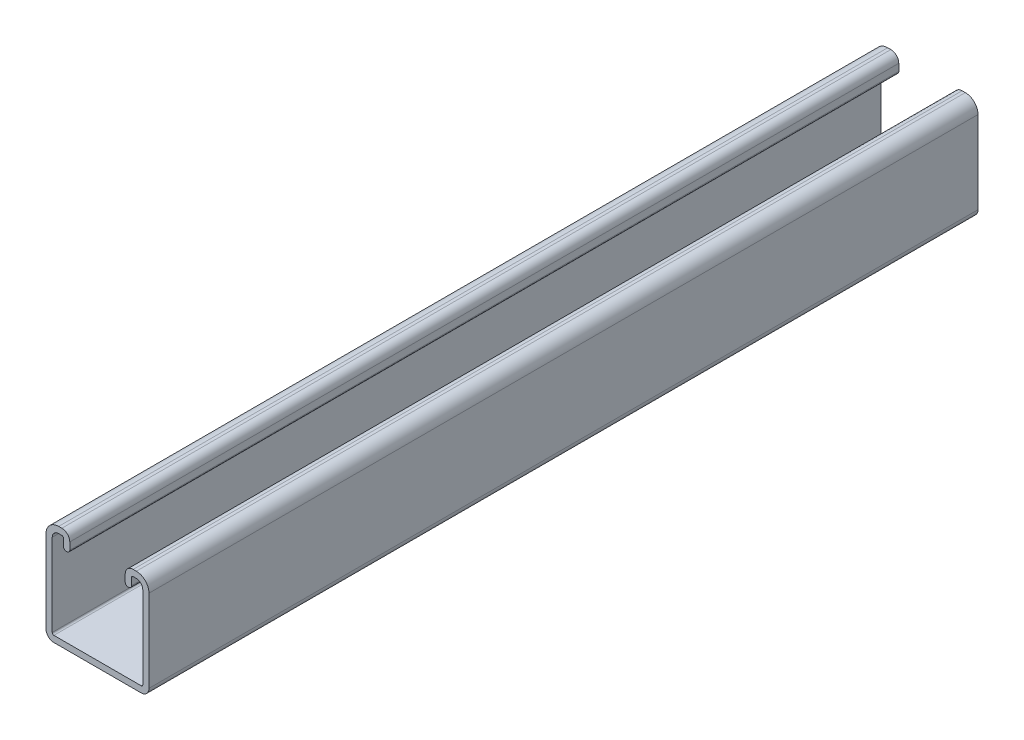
ISO-10303-21;
HEADER;
FILE_DESCRIPTION(('STEP AP214'),'2;1');
FILE_NAME('part.step','',(''),(''),'','','');
FILE_SCHEMA(('AUTOMOTIVE_DESIGN { 1 0 10303 214 1 1 1 1 }'));
ENDSEC;
DATA;
#1=APPLICATION_CONTEXT('core data for automotive mechanical design processes');
#2=APPLICATION_PROTOCOL_DEFINITION('international standard','automotive_design',2000,#1);
#3=PRODUCT_CONTEXT('',#1,'mechanical');
#4=PRODUCT('Part','Part','',(#3));
#5=PRODUCT_RELATED_PRODUCT_CATEGORY('part','',(#4));
#6=PRODUCT_DEFINITION_FORMATION('','',#4);
#7=PRODUCT_DEFINITION_CONTEXT('part definition',#1,'design');
#8=PRODUCT_DEFINITION('design','',#6,#7);
#9=PRODUCT_DEFINITION_SHAPE('','',#8);
#10=(LENGTH_UNIT() NAMED_UNIT(*) SI_UNIT(.MILLI.,.METRE.));
#11=(NAMED_UNIT(*) PLANE_ANGLE_UNIT() SI_UNIT($,.RADIAN.));
#12=(NAMED_UNIT(*) SI_UNIT($,.STERADIAN.) SOLID_ANGLE_UNIT());
#13=UNCERTAINTY_MEASURE_WITH_UNIT(LENGTH_MEASURE(1.E-05),#10,'distance_accuracy_value','');
#14=(GEOMETRIC_REPRESENTATION_CONTEXT(3) GLOBAL_UNCERTAINTY_ASSIGNED_CONTEXT((#13)) GLOBAL_UNIT_ASSIGNED_CONTEXT((#10,
#11,#12)) REPRESENTATION_CONTEXT('',''));
#15=CARTESIAN_POINT('',(0.,0.,0.));
#16=DIRECTION('',(0.,0.,1.));
#17=DIRECTION('',(1.,0.,0.));
#18=AXIS2_PLACEMENT_3D('',#15,#16,#17);
#19=CARTESIAN_POINT('',(0.,36.195,332.232));
#20=DIRECTION('',(1.,0.,0.));
#21=DIRECTION('',(0.,1.,0.));
#22=AXIS2_PLACEMENT_3D('',#19,#20,#21);
#23=PLANE('',#22);
#24=DIRECTION('',(0.,-1.,0.));
#25=VECTOR('',#24,1.);
#26=CARTESIAN_POINT('',(0.,36.195,0.));
#27=LINE('',#26,#25);
#28=CARTESIAN_POINT('',(0.,36.195,0.));
#29=VERTEX_POINT('',#28);
#30=CARTESIAN_POINT('',(0.,3.17500000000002,0.));
#31=VERTEX_POINT('',#30);
#32=EDGE_CURVE('E275',#29,#31,#27,.T.);
#33=ORIENTED_EDGE('',*,*,#32,.T.);
#34=DIRECTION('',(0.,0.,-1.));
#35=VECTOR('',#34,1.);
#36=CARTESIAN_POINT('',(0.,3.17500000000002,332.232));
#37=LINE('',#36,#35);
#38=CARTESIAN_POINT('',(0.,3.17500000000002,332.232));
#39=VERTEX_POINT('',#38);
#40=EDGE_CURVE('E11',#39,#31,#37,.T.);
#41=ORIENTED_EDGE('',*,*,#40,.F.);
#42=DIRECTION('',(0.,-1.,0.));
#43=VECTOR('',#42,1.);
#44=CARTESIAN_POINT('',(0.,36.195,332.232));
#45=LINE('',#44,#43);
#46=CARTESIAN_POINT('',(0.,36.195,332.232));
#47=VERTEX_POINT('',#46);
#48=EDGE_CURVE('E358',#47,#39,#45,.T.);
#49=ORIENTED_EDGE('',*,*,#48,.F.);
#50=DIRECTION('',(0.,0.,-1.));
#51=VECTOR('',#50,1.);
#52=CARTESIAN_POINT('',(0.,36.195,332.232));
#53=LINE('',#52,#51);
#54=EDGE_CURVE('E51',#47,#29,#53,.T.);
#55=ORIENTED_EDGE('',*,*,#54,.T.);
#56=EDGE_LOOP('',(#33,#41,#49,#55));
#57=FACE_BOUND('',#56,.T.);
#58=ADVANCED_FACE('F35',(#57),#23,.F.);
#59=CARTESIAN_POINT('',(3.17499999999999,3.175,332.232));
#60=DIRECTION('',(0.,0.,-1.));
#61=DIRECTION('',(-1.,0.,0.));
#62=AXIS2_PLACEMENT_3D('',#59,#60,#61);
#63=CYLINDRICAL_SURFACE('',#62,3.175);
#64=CARTESIAN_POINT('',(3.17499999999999,3.175,0.));
#65=DIRECTION('',(0.,0.,1.));
#66=DIRECTION('',(1.,0.,0.));
#67=AXIS2_PLACEMENT_3D('',#64,#65,#66);
#68=CIRCLE('',#67,3.175);
#69=CARTESIAN_POINT('',(3.17500000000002,0.,0.));
#70=VERTEX_POINT('',#69);
#71=EDGE_CURVE('E277',#31,#70,#68,.T.);
#72=ORIENTED_EDGE('',*,*,#71,.T.);
#73=DIRECTION('',(0.,0.,-1.));
#74=VECTOR('',#73,1.);
#75=CARTESIAN_POINT('',(3.17500000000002,0.,332.232));
#76=LINE('',#75,#74);
#77=CARTESIAN_POINT('',(3.17500000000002,0.,332.232));
#78=VERTEX_POINT('',#77);
#79=EDGE_CURVE('E43',#78,#70,#76,.T.);
#80=ORIENTED_EDGE('',*,*,#79,.F.);
#81=CARTESIAN_POINT('',(3.17499999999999,3.175,332.232));
#82=DIRECTION('',(0.,0.,1.));
#83=DIRECTION('',(1.,0.,0.));
#84=AXIS2_PLACEMENT_3D('',#81,#82,#83);
#85=CIRCLE('',#84,3.175);
#86=EDGE_CURVE('E161',#39,#78,#85,.T.);
#87=ORIENTED_EDGE('',*,*,#86,.F.);
#88=ORIENTED_EDGE('',*,*,#40,.T.);
#89=EDGE_LOOP('',(#72,#80,#87,#88));
#90=FACE_BOUND('',#89,.T.);
#91=ADVANCED_FACE('F516',(#90),#63,.T.);
#92=CARTESIAN_POINT('',(3.17500000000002,0.,332.232));
#93=DIRECTION('',(0.,1.,0.));
#94=DIRECTION('',(0.,0.,1.));
#95=AXIS2_PLACEMENT_3D('',#92,#93,#94);
#96=PLANE('',#95);
#97=CARTESIAN_POINT('',(20.6375,0.,272.693321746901));
#98=DIRECTION('',(0.,1.,0.));
#99=DIRECTION('',(0.,0.,1.));
#100=AXIS2_PLACEMENT_3D('',#97,#98,#99);
#101=CIRCLE('',#100,2.54);
#102=CARTESIAN_POINT('',(20.6375,0.,275.233321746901));
#103=VERTEX_POINT('',#102);
#104=EDGE_CURVE('E527',#103,#103,#101,.T.);
#105=ORIENTED_EDGE('',*,*,#104,.T.);
#106=EDGE_LOOP('',(#105));
#107=FACE_BOUND('',#106,.T.);
#108=CARTESIAN_POINT('',(20.6375,0.,50.8));
#109=DIRECTION('',(0.,1.,0.));
#110=DIRECTION('',(0.,0.,1.));
#111=AXIS2_PLACEMENT_3D('',#108,#109,#110);
#112=CIRCLE('',#111,2.54);
#113=CARTESIAN_POINT('',(20.6375,0.,53.34));
#114=VERTEX_POINT('',#113);
#115=EDGE_CURVE('E278',#114,#114,#112,.T.);
#116=ORIENTED_EDGE('',*,*,#115,.T.);
#117=EDGE_LOOP('',(#116));
#118=FACE_BOUND('',#117,.T.);
#119=CARTESIAN_POINT('',(20.6375,0.,127.));
#120=DIRECTION('',(0.,1.,0.));
#121=DIRECTION('',(0.,0.,1.));
#122=AXIS2_PLACEMENT_3D('',#119,#120,#121);
#123=CIRCLE('',#122,2.54);
#124=CARTESIAN_POINT('',(20.6375,0.,129.54));
#125=VERTEX_POINT('',#124);
#126=EDGE_CURVE('E533',#125,#125,#123,.T.);
#127=ORIENTED_EDGE('',*,*,#126,.T.);
#128=EDGE_LOOP('',(#127));
#129=FACE_BOUND('',#128,.T.);
#130=CARTESIAN_POINT('',(20.6375,0.,203.2));
#131=DIRECTION('',(0.,1.,0.));
#132=DIRECTION('',(0.,0.,1.));
#133=AXIS2_PLACEMENT_3D('',#130,#131,#132);
#134=CIRCLE('',#133,2.54);
#135=CARTESIAN_POINT('',(20.6375,0.,205.74));
#136=VERTEX_POINT('',#135);
#137=EDGE_CURVE('E526',#136,#136,#134,.T.);
#138=ORIENTED_EDGE('',*,*,#137,.T.);
#139=EDGE_LOOP('',(#138));
#140=FACE_BOUND('',#139,.T.);
#141=DIRECTION('',(1.,0.,0.));
#142=VECTOR('',#141,1.);
#143=CARTESIAN_POINT('',(3.17500000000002,0.,0.));
#144=LINE('',#143,#142);
#145=CARTESIAN_POINT('',(38.1,0.,0.));
#146=VERTEX_POINT('',#145);
#147=EDGE_CURVE('E280',#70,#146,#144,.T.);
#148=ORIENTED_EDGE('',*,*,#147,.T.);
#149=DIRECTION('',(0.,0.,-1.));
#150=VECTOR('',#149,1.);
#151=CARTESIAN_POINT('',(38.1,0.,332.232));
#152=LINE('',#151,#150);
#153=CARTESIAN_POINT('',(38.1,0.,332.232));
#154=VERTEX_POINT('',#153);
#155=EDGE_CURVE('E421',#154,#146,#152,.T.);
#156=ORIENTED_EDGE('',*,*,#155,.F.);
#157=DIRECTION('',(1.,0.,0.));
#158=VECTOR('',#157,1.);
#159=CARTESIAN_POINT('',(3.17500000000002,0.,332.232));
#160=LINE('',#159,#158);
#161=EDGE_CURVE('E428',#78,#154,#160,.T.);
#162=ORIENTED_EDGE('',*,*,#161,.F.);
#163=ORIENTED_EDGE('',*,*,#79,.T.);
#164=EDGE_LOOP('',(#148,#156,#162,#163));
#165=FACE_BOUND('',#164,.T.);
#166=ADVANCED_FACE('F426',(#107,#118,#129,#140,#165),#96,.F.);
#167=CARTESIAN_POINT('',(38.1,3.175,332.232));
#168=DIRECTION('',(0.,0.,-1.));
#169=DIRECTION('',(-1.,0.,0.));
#170=AXIS2_PLACEMENT_3D('',#167,#168,#169);
#171=CYLINDRICAL_SURFACE('',#170,3.175);
#172=CARTESIAN_POINT('',(38.1,3.175,0.));
#173=DIRECTION('',(0.,0.,-1.));
#174=DIRECTION('',(-1.,0.,0.));
#175=AXIS2_PLACEMENT_3D('',#172,#173,#174);
#176=CIRCLE('',#175,3.175);
#177=CARTESIAN_POINT('',(41.275,3.17500000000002,0.));
#178=VERTEX_POINT('',#177);
#179=EDGE_CURVE('E283',#178,#146,#176,.T.);
#180=ORIENTED_EDGE('',*,*,#179,.F.);
#181=DIRECTION('',(0.,0.,-1.));
#182=VECTOR('',#181,1.);
#183=CARTESIAN_POINT('',(41.275,3.17500000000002,332.232));
#184=LINE('',#183,#182);
#185=CARTESIAN_POINT('',(41.275,3.17500000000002,332.232));
#186=VERTEX_POINT('',#185);
#187=EDGE_CURVE('E419',#186,#178,#184,.T.);
#188=ORIENTED_EDGE('',*,*,#187,.F.);
#189=CARTESIAN_POINT('',(38.1,3.175,332.232));
#190=DIRECTION('',(0.,0.,-1.));
#191=DIRECTION('',(-1.,0.,0.));
#192=AXIS2_PLACEMENT_3D('',#189,#190,#191);
#193=CIRCLE('',#192,3.175);
#194=EDGE_CURVE('E438',#186,#154,#193,.T.);
#195=ORIENTED_EDGE('',*,*,#194,.T.);
#196=ORIENTED_EDGE('',*,*,#155,.T.);
#197=EDGE_LOOP('',(#180,#188,#195,#196));
#198=FACE_BOUND('',#197,.T.);
#199=ADVANCED_FACE('F435',(#198),#171,.T.);
#200=CARTESIAN_POINT('',(41.275,36.195,332.232));
#201=DIRECTION('',(1.,0.,0.));
#202=DIRECTION('',(0.,1.,0.));
#203=AXIS2_PLACEMENT_3D('',#200,#201,#202);
#204=PLANE('',#203);
#205=DIRECTION('',(0.,-1.,0.));
#206=VECTOR('',#205,1.);
#207=CARTESIAN_POINT('',(41.275,36.195,0.));
#208=LINE('',#207,#206);
#209=CARTESIAN_POINT('',(41.275,36.195,0.));
#210=VERTEX_POINT('',#209);
#211=EDGE_CURVE('E286',#210,#178,#208,.T.);
#212=ORIENTED_EDGE('',*,*,#211,.F.);
#213=DIRECTION('',(0.,0.,-1.));
#214=VECTOR('',#213,1.);
#215=CARTESIAN_POINT('',(41.275,36.195,332.232));
#216=LINE('',#215,#214);
#217=CARTESIAN_POINT('',(41.275,36.195,332.232));
#218=VERTEX_POINT('',#217);
#219=EDGE_CURVE('E417',#218,#210,#216,.T.);
#220=ORIENTED_EDGE('',*,*,#219,.F.);
#221=DIRECTION('',(0.,-1.,0.));
#222=VECTOR('',#221,1.);
#223=CARTESIAN_POINT('',(41.275,36.195,332.232));
#224=LINE('',#223,#222);
#225=EDGE_CURVE('E441',#218,#186,#224,.T.);
#226=ORIENTED_EDGE('',*,*,#225,.T.);
#227=ORIENTED_EDGE('',*,*,#187,.T.);
#228=EDGE_LOOP('',(#212,#220,#226,#227));
#229=FACE_BOUND('',#228,.T.);
#230=ADVANCED_FACE('F685',(#229),#204,.T.);
#231=CARTESIAN_POINT('',(36.195,36.195,332.232));
#232=DIRECTION('',(0.,0.,-1.));
#233=DIRECTION('',(-1.,0.,0.));
#234=AXIS2_PLACEMENT_3D('',#231,#232,#233);
#235=CYLINDRICAL_SURFACE('',#234,5.08);
#236=CARTESIAN_POINT('',(36.195,36.195,0.));
#237=DIRECTION('',(0.,0.,1.));
#238=DIRECTION('',(1.,0.,0.));
#239=AXIS2_PLACEMENT_3D('',#236,#237,#238);
#240=CIRCLE('',#239,5.08);
#241=CARTESIAN_POINT('',(36.195,41.275,0.));
#242=VERTEX_POINT('',#241);
#243=EDGE_CURVE('E289',#210,#242,#240,.T.);
#244=ORIENTED_EDGE('',*,*,#243,.T.);
#245=DIRECTION('',(0.,0.,-1.));
#246=VECTOR('',#245,1.);
#247=CARTESIAN_POINT('',(36.195,41.275,332.232));
#248=LINE('',#247,#246);
#249=CARTESIAN_POINT('',(36.195,41.275,332.232));
#250=VERTEX_POINT('',#249);
#251=EDGE_CURVE('E415',#250,#242,#248,.T.);
#252=ORIENTED_EDGE('',*,*,#251,.F.);
#253=CARTESIAN_POINT('',(36.195,36.195,332.232));
#254=DIRECTION('',(0.,0.,1.));
#255=DIRECTION('',(1.,0.,0.));
#256=AXIS2_PLACEMENT_3D('',#253,#254,#255);
#257=CIRCLE('',#256,5.08);
#258=EDGE_CURVE('E443',#218,#250,#257,.T.);
#259=ORIENTED_EDGE('',*,*,#258,.F.);
#260=ORIENTED_EDGE('',*,*,#219,.T.);
#261=EDGE_LOOP('',(#244,#252,#259,#260));
#262=FACE_BOUND('',#261,.T.);
#263=ADVANCED_FACE('F681',(#262),#235,.T.);
#264=CARTESIAN_POINT('',(34.925,41.275,332.232));
#265=DIRECTION('',(0.,1.,0.));
#266=DIRECTION('',(0.,0.,1.));
#267=AXIS2_PLACEMENT_3D('',#264,#265,#266);
#268=PLANE('',#267);
#269=DIRECTION('',(1.,0.,0.));
#270=VECTOR('',#269,1.);
#271=CARTESIAN_POINT('',(34.925,41.275,0.));
#272=LINE('',#271,#270);
#273=CARTESIAN_POINT('',(34.925,41.275,0.));
#274=VERTEX_POINT('',#273);
#275=EDGE_CURVE('E292',#274,#242,#272,.T.);
#276=ORIENTED_EDGE('',*,*,#275,.F.);
#277=DIRECTION('',(0.,0.,-1.));
#278=VECTOR('',#277,1.);
#279=CARTESIAN_POINT('',(34.925,41.275,332.232));
#280=LINE('',#279,#278);
#281=CARTESIAN_POINT('',(34.925,41.275,332.232));
#282=VERTEX_POINT('',#281);
#283=EDGE_CURVE('E413',#282,#274,#280,.T.);
#284=ORIENTED_EDGE('',*,*,#283,.F.);
#285=DIRECTION('',(1.,0.,0.));
#286=VECTOR('',#285,1.);
#287=CARTESIAN_POINT('',(34.925,41.275,332.232));
#288=LINE('',#287,#286);
#289=EDGE_CURVE('E449',#282,#250,#288,.T.);
#290=ORIENTED_EDGE('',*,*,#289,.T.);
#291=ORIENTED_EDGE('',*,*,#251,.T.);
#292=EDGE_LOOP('',(#276,#284,#290,#291));
#293=FACE_BOUND('',#292,.T.);
#294=ADVANCED_FACE('F677',(#293),#268,.T.);
#295=CARTESIAN_POINT('',(34.925,38.1,332.232));
#296=DIRECTION('',(0.,0.,-1.));
#297=DIRECTION('',(-1.,0.,0.));
#298=AXIS2_PLACEMENT_3D('',#295,#296,#297);
#299=CYLINDRICAL_SURFACE('',#298,3.175);
#300=CARTESIAN_POINT('',(34.925,38.1,0.));
#301=DIRECTION('',(0.,0.,-1.));
#302=DIRECTION('',(-1.,0.,0.));
#303=AXIS2_PLACEMENT_3D('',#300,#301,#302);
#304=CIRCLE('',#303,3.175);
#305=CARTESIAN_POINT('',(31.75,38.1,0.));
#306=VERTEX_POINT('',#305);
#307=EDGE_CURVE('E295',#306,#274,#304,.T.);
#308=ORIENTED_EDGE('',*,*,#307,.F.);
#309=DIRECTION('',(0.,0.,-1.));
#310=VECTOR('',#309,1.);
#311=CARTESIAN_POINT('',(31.75,38.1,332.232));
#312=LINE('',#311,#310);
#313=CARTESIAN_POINT('',(31.75,38.1,332.232));
#314=VERTEX_POINT('',#313);
#315=EDGE_CURVE('E411',#314,#306,#312,.T.);
#316=ORIENTED_EDGE('',*,*,#315,.F.);
#317=CARTESIAN_POINT('',(34.925,38.1,332.232));
#318=DIRECTION('',(0.,0.,-1.));
#319=DIRECTION('',(-1.,0.,0.));
#320=AXIS2_PLACEMENT_3D('',#317,#318,#319);
#321=CIRCLE('',#320,3.175);
#322=EDGE_CURVE('E452',#314,#282,#321,.T.);
#323=ORIENTED_EDGE('',*,*,#322,.T.);
#324=ORIENTED_EDGE('',*,*,#283,.T.);
#325=EDGE_LOOP('',(#308,#316,#323,#324));
#326=FACE_BOUND('',#325,.T.);
#327=ADVANCED_FACE('F673',(#326),#299,.T.);
#328=CARTESIAN_POINT('',(31.75,38.1,332.232));
#329=DIRECTION('',(1.,0.,0.));
#330=DIRECTION('',(0.,1.,0.));
#331=AXIS2_PLACEMENT_3D('',#328,#329,#330);
#332=PLANE('',#331);
#333=DIRECTION('',(0.,-1.,0.));
#334=VECTOR('',#333,1.);
#335=CARTESIAN_POINT('',(31.75,38.1,0.));
#336=LINE('',#335,#334);
#337=CARTESIAN_POINT('',(31.75,35.27425,0.));
#338=VERTEX_POINT('',#337);
#339=EDGE_CURVE('E298',#306,#338,#336,.T.);
#340=ORIENTED_EDGE('',*,*,#339,.T.);
#341=DIRECTION('',(0.,0.,-1.));
#342=VECTOR('',#341,1.);
#343=CARTESIAN_POINT('',(31.75,35.27425,332.232));
#344=LINE('',#343,#342);
#345=CARTESIAN_POINT('',(31.75,35.27425,332.232));
#346=VERTEX_POINT('',#345);
#347=EDGE_CURVE('E408',#346,#338,#344,.T.);
#348=ORIENTED_EDGE('',*,*,#347,.F.);
#349=DIRECTION('',(0.,-1.,0.));
#350=VECTOR('',#349,1.);
#351=CARTESIAN_POINT('',(31.75,38.1,332.232));
#352=LINE('',#351,#350);
#353=EDGE_CURVE('E455',#314,#346,#352,.T.);
#354=ORIENTED_EDGE('',*,*,#353,.F.);
#355=ORIENTED_EDGE('',*,*,#315,.T.);
#356=EDGE_LOOP('',(#340,#348,#354,#355));
#357=FACE_BOUND('',#356,.T.);
#358=ADVANCED_FACE('F669',(#357),#332,.F.);
#359=CARTESIAN_POINT('',(32.893,35.27425,332.232));
#360=DIRECTION('',(0.,0.,-1.));
#361=DIRECTION('',(-1.,0.,0.));
#362=AXIS2_PLACEMENT_3D('',#359,#360,#361);
#363=CYLINDRICAL_SURFACE('',#362,1.143);
#364=CARTESIAN_POINT('',(32.893,35.27425,0.));
#365=DIRECTION('',(0.,0.,1.));
#366=DIRECTION('',(1.,0.,0.));
#367=AXIS2_PLACEMENT_3D('',#364,#365,#366);
#368=CIRCLE('',#367,1.143);
#369=CARTESIAN_POINT('',(32.893,34.13125,0.));
#370=VERTEX_POINT('',#369);
#371=EDGE_CURVE('E300',#338,#370,#368,.T.);
#372=ORIENTED_EDGE('',*,*,#371,.T.);
#373=DIRECTION('',(0.,0.,-1.));
#374=VECTOR('',#373,1.);
#375=CARTESIAN_POINT('',(32.893,34.13125,332.232));
#376=LINE('',#375,#374);
#377=CARTESIAN_POINT('',(32.893,34.13125,332.232));
#378=VERTEX_POINT('',#377);
#379=EDGE_CURVE('E405',#378,#370,#376,.T.);
#380=ORIENTED_EDGE('',*,*,#379,.F.);
#381=CARTESIAN_POINT('',(32.893,35.27425,332.232));
#382=DIRECTION('',(0.,0.,1.));
#383=DIRECTION('',(1.,0.,0.));
#384=AXIS2_PLACEMENT_3D('',#381,#382,#383);
#385=CIRCLE('',#384,1.143);
#386=EDGE_CURVE('E457',#346,#378,#385,.T.);
#387=ORIENTED_EDGE('',*,*,#386,.F.);
#388=ORIENTED_EDGE('',*,*,#347,.T.);
#389=EDGE_LOOP('',(#372,#380,#387,#388));
#390=FACE_BOUND('',#389,.T.);
#391=ADVANCED_FACE('F665',(#390),#363,.T.);
#392=CARTESIAN_POINT('',(32.893,34.13125,332.232));
#393=DIRECTION('',(0.,1.,0.));
#394=DIRECTION('',(0.,0.,1.));
#395=AXIS2_PLACEMENT_3D('',#392,#393,#394);
#396=PLANE('',#395);
#397=DIRECTION('',(1.,0.,0.));
#398=VECTOR('',#397,1.);
#399=CARTESIAN_POINT('',(32.893,34.13125,0.));
#400=LINE('',#399,#398);
#401=CARTESIAN_POINT('',(33.107,34.13125,0.));
#402=VERTEX_POINT('',#401);
#403=EDGE_CURVE('E302',#370,#402,#400,.T.);
#404=ORIENTED_EDGE('',*,*,#403,.T.);
#405=DIRECTION('',(0.,0.,-1.));
#406=VECTOR('',#405,1.);
#407=CARTESIAN_POINT('',(33.107,34.13125,332.232));
#408=LINE('',#407,#406);
#409=CARTESIAN_POINT('',(33.107,34.13125,332.232));
#410=VERTEX_POINT('',#409);
#411=EDGE_CURVE('E402',#410,#402,#408,.T.);
#412=ORIENTED_EDGE('',*,*,#411,.F.);
#413=DIRECTION('',(1.,0.,0.));
#414=VECTOR('',#413,1.);
#415=CARTESIAN_POINT('',(32.893,34.13125,332.232));
#416=LINE('',#415,#414);
#417=EDGE_CURVE('E459',#378,#410,#416,.T.);
#418=ORIENTED_EDGE('',*,*,#417,.F.);
#419=ORIENTED_EDGE('',*,*,#379,.T.);
#420=EDGE_LOOP('',(#404,#412,#418,#419));
#421=FACE_BOUND('',#420,.T.);
#422=ADVANCED_FACE('F661',(#421),#396,.F.);
#423=CARTESIAN_POINT('',(33.107,35.27425,332.232));
#424=DIRECTION('',(0.,0.,-1.));
#425=DIRECTION('',(-1.,0.,0.));
#426=AXIS2_PLACEMENT_3D('',#423,#424,#425);
#427=CYLINDRICAL_SURFACE('',#426,1.143);
#428=CARTESIAN_POINT('',(33.107,35.27425,0.));
#429=DIRECTION('',(0.,0.,1.));
#430=DIRECTION('',(1.,0.,0.));
#431=AXIS2_PLACEMENT_3D('',#428,#429,#430);
#432=CIRCLE('',#431,1.143);
#433=CARTESIAN_POINT('',(34.25,35.27425,0.));
#434=VERTEX_POINT('',#433);
#435=EDGE_CURVE('E304',#402,#434,#432,.T.);
#436=ORIENTED_EDGE('',*,*,#435,.T.);
#437=DIRECTION('',(0.,0.,-1.));
#438=VECTOR('',#437,1.);
#439=CARTESIAN_POINT('',(34.25,35.27425,332.232));
#440=LINE('',#439,#438);
#441=CARTESIAN_POINT('',(34.25,35.27425,332.232));
#442=VERTEX_POINT('',#441);
#443=EDGE_CURVE('E400',#442,#434,#440,.T.);
#444=ORIENTED_EDGE('',*,*,#443,.F.);
#445=CARTESIAN_POINT('',(33.107,35.27425,332.232));
#446=DIRECTION('',(0.,0.,1.));
#447=DIRECTION('',(1.,0.,0.));
#448=AXIS2_PLACEMENT_3D('',#445,#446,#447);
#449=CIRCLE('',#448,1.143);
#450=EDGE_CURVE('E461',#410,#442,#449,.T.);
#451=ORIENTED_EDGE('',*,*,#450,.F.);
#452=ORIENTED_EDGE('',*,*,#411,.T.);
#453=EDGE_LOOP('',(#436,#444,#451,#452));
#454=FACE_BOUND('',#453,.T.);
#455=ADVANCED_FACE('F657',(#454),#427,.T.);
#456=CARTESIAN_POINT('',(34.25,38.1,332.232));
#457=DIRECTION('',(1.,0.,0.));
#458=DIRECTION('',(0.,0.,-1.));
#459=AXIS2_PLACEMENT_3D('',#456,#457,#458);
#460=PLANE('',#459);
#461=DIRECTION('',(0.,-1.,0.));
#462=VECTOR('',#461,1.);
#463=CARTESIAN_POINT('',(34.25,38.1,0.));
#464=LINE('',#463,#462);
#465=CARTESIAN_POINT('',(34.25,38.1,0.));
#466=VERTEX_POINT('',#465);
#467=EDGE_CURVE('E307',#466,#434,#464,.T.);
#468=ORIENTED_EDGE('',*,*,#467,.F.);
#469=DIRECTION('',(0.,0.,-1.));
#470=VECTOR('',#469,1.);
#471=CARTESIAN_POINT('',(34.25,38.1,332.232));
#472=LINE('',#471,#470);
#473=CARTESIAN_POINT('',(34.25,38.1,332.232));
#474=VERTEX_POINT('',#473);
#475=EDGE_CURVE('E398',#474,#466,#472,.T.);
#476=ORIENTED_EDGE('',*,*,#475,.F.);
#477=DIRECTION('',(0.,-1.,0.));
#478=VECTOR('',#477,1.);
#479=CARTESIAN_POINT('',(34.25,38.1,332.232));
#480=LINE('',#479,#478);
#481=EDGE_CURVE('E463',#474,#442,#480,.T.);
#482=ORIENTED_EDGE('',*,*,#481,.T.);
#483=ORIENTED_EDGE('',*,*,#443,.T.);
#484=EDGE_LOOP('',(#468,#476,#482,#483));
#485=FACE_BOUND('',#484,.T.);
#486=ADVANCED_FACE('F653',(#485),#460,.T.);
#487=CARTESIAN_POINT('',(34.925,38.1,332.232));
#488=DIRECTION('',(0.,0.,-1.));
#489=DIRECTION('',(-1.,0.,0.));
#490=AXIS2_PLACEMENT_3D('',#487,#488,#489);
#491=CYLINDRICAL_SURFACE('',#490,0.674999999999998);
#492=CARTESIAN_POINT('',(34.925,38.1,0.));
#493=DIRECTION('',(0.,0.,-1.));
#494=DIRECTION('',(-1.,0.,0.));
#495=AXIS2_PLACEMENT_3D('',#492,#493,#494);
#496=CIRCLE('',#495,0.674999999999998);
#497=CARTESIAN_POINT('',(34.925,38.775,0.));
#498=VERTEX_POINT('',#497);
#499=EDGE_CURVE('E310',#466,#498,#496,.T.);
#500=ORIENTED_EDGE('',*,*,#499,.T.);
#501=DIRECTION('',(0.,0.,-1.));
#502=VECTOR('',#501,1.);
#503=CARTESIAN_POINT('',(34.925,38.775,332.232));
#504=LINE('',#503,#502);
#505=CARTESIAN_POINT('',(34.925,38.775,332.232));
#506=VERTEX_POINT('',#505);
#507=EDGE_CURVE('E395',#506,#498,#504,.T.);
#508=ORIENTED_EDGE('',*,*,#507,.F.);
#509=CARTESIAN_POINT('',(34.925,38.1,332.232));
#510=DIRECTION('',(0.,0.,-1.));
#511=DIRECTION('',(-1.,0.,0.));
#512=AXIS2_PLACEMENT_3D('',#509,#510,#511);
#513=CIRCLE('',#512,0.674999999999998);
#514=EDGE_CURVE('E466',#474,#506,#513,.T.);
#515=ORIENTED_EDGE('',*,*,#514,.F.);
#516=ORIENTED_EDGE('',*,*,#475,.T.);
#517=EDGE_LOOP('',(#500,#508,#515,#516));
#518=FACE_BOUND('',#517,.T.);
#519=ADVANCED_FACE('F649',(#518),#491,.F.);
#520=CARTESIAN_POINT('',(34.925,38.775,332.232));
#521=DIRECTION('',(0.,1.,0.));
#522=DIRECTION('',(0.,0.,1.));
#523=AXIS2_PLACEMENT_3D('',#520,#521,#522);
#524=PLANE('',#523);
#525=DIRECTION('',(1.,0.,0.));
#526=VECTOR('',#525,1.);
#527=CARTESIAN_POINT('',(34.925,38.775,0.));
#528=LINE('',#527,#526);
#529=CARTESIAN_POINT('',(36.195,38.775,0.));
#530=VERTEX_POINT('',#529);
#531=EDGE_CURVE('E312',#498,#530,#528,.T.);
#532=ORIENTED_EDGE('',*,*,#531,.T.);
#533=DIRECTION('',(0.,0.,-1.));
#534=VECTOR('',#533,1.);
#535=CARTESIAN_POINT('',(36.195,38.775,332.232));
#536=LINE('',#535,#534);
#537=CARTESIAN_POINT('',(36.195,38.775,332.232));
#538=VERTEX_POINT('',#537);
#539=EDGE_CURVE('E393',#538,#530,#536,.T.);
#540=ORIENTED_EDGE('',*,*,#539,.F.);
#541=DIRECTION('',(1.,0.,0.));
#542=VECTOR('',#541,1.);
#543=CARTESIAN_POINT('',(34.925,38.775,332.232));
#544=LINE('',#543,#542);
#545=EDGE_CURVE('E468',#506,#538,#544,.T.);
#546=ORIENTED_EDGE('',*,*,#545,.F.);
#547=ORIENTED_EDGE('',*,*,#507,.T.);
#548=EDGE_LOOP('',(#532,#540,#546,#547));
#549=FACE_BOUND('',#548,.T.);
#550=ADVANCED_FACE('F645',(#549),#524,.F.);
#551=CARTESIAN_POINT('',(36.195,36.195,332.232));
#552=DIRECTION('',(0.,0.,-1.));
#553=DIRECTION('',(-1.,0.,0.));
#554=AXIS2_PLACEMENT_3D('',#551,#552,#553);
#555=CYLINDRICAL_SURFACE('',#554,2.58);
#556=CARTESIAN_POINT('',(36.195,36.195,0.));
#557=DIRECTION('',(0.,0.,1.));
#558=DIRECTION('',(1.,0.,0.));
#559=AXIS2_PLACEMENT_3D('',#556,#557,#558);
#560=CIRCLE('',#559,2.58);
#561=CARTESIAN_POINT('',(38.775,36.195,0.));
#562=VERTEX_POINT('',#561);
#563=EDGE_CURVE('E315',#562,#530,#560,.T.);
#564=ORIENTED_EDGE('',*,*,#563,.F.);
#565=DIRECTION('',(0.,0.,-1.));
#566=VECTOR('',#565,1.);
#567=CARTESIAN_POINT('',(38.775,36.195,332.232));
#568=LINE('',#567,#566);
#569=CARTESIAN_POINT('',(38.775,36.195,332.232));
#570=VERTEX_POINT('',#569);
#571=EDGE_CURVE('E391',#570,#562,#568,.T.);
#572=ORIENTED_EDGE('',*,*,#571,.F.);
#573=CARTESIAN_POINT('',(36.195,36.195,332.232));
#574=DIRECTION('',(0.,0.,1.));
#575=DIRECTION('',(1.,0.,0.));
#576=AXIS2_PLACEMENT_3D('',#573,#574,#575);
#577=CIRCLE('',#576,2.58);
#578=EDGE_CURVE('E470',#570,#538,#577,.T.);
#579=ORIENTED_EDGE('',*,*,#578,.T.);
#580=ORIENTED_EDGE('',*,*,#539,.T.);
#581=EDGE_LOOP('',(#564,#572,#579,#580));
#582=FACE_BOUND('',#581,.T.);
#583=ADVANCED_FACE('F641',(#582),#555,.F.);
#584=CARTESIAN_POINT('',(38.775,36.195,332.232));
#585=DIRECTION('',(1.,0.,0.));
#586=DIRECTION('',(0.,1.,0.));
#587=AXIS2_PLACEMENT_3D('',#584,#585,#586);
#588=PLANE('',#587);
#589=DIRECTION('',(0.,-1.,0.));
#590=VECTOR('',#589,1.);
#591=CARTESIAN_POINT('',(38.775,36.195,0.));
#592=LINE('',#591,#590);
#593=CARTESIAN_POINT('',(38.775,3.175,0.));
#594=VERTEX_POINT('',#593);
#595=EDGE_CURVE('E318',#562,#594,#592,.T.);
#596=ORIENTED_EDGE('',*,*,#595,.T.);
#597=DIRECTION('',(0.,0.,-1.));
#598=VECTOR('',#597,1.);
#599=CARTESIAN_POINT('',(38.775,3.175,332.232));
#600=LINE('',#599,#598);
#601=CARTESIAN_POINT('',(38.775,3.175,332.232));
#602=VERTEX_POINT('',#601);
#603=EDGE_CURVE('E388',#602,#594,#600,.T.);
#604=ORIENTED_EDGE('',*,*,#603,.F.);
#605=DIRECTION('',(0.,-1.,0.));
#606=VECTOR('',#605,1.);
#607=CARTESIAN_POINT('',(38.775,36.195,332.232));
#608=LINE('',#607,#606);
#609=EDGE_CURVE('E473',#570,#602,#608,.T.);
#610=ORIENTED_EDGE('',*,*,#609,.F.);
#611=ORIENTED_EDGE('',*,*,#571,.T.);
#612=EDGE_LOOP('',(#596,#604,#610,#611));
#613=FACE_BOUND('',#612,.T.);
#614=ADVANCED_FACE('F637',(#613),#588,.F.);
#615=CARTESIAN_POINT('',(38.1,3.175,332.232));
#616=DIRECTION('',(0.,0.,-1.));
#617=DIRECTION('',(-1.,0.,0.));
#618=AXIS2_PLACEMENT_3D('',#615,#616,#617);
#619=CYLINDRICAL_SURFACE('',#618,0.674999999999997);
#620=CARTESIAN_POINT('',(38.1,3.175,0.));
#621=DIRECTION('',(0.,0.,-1.));
#622=DIRECTION('',(-1.,0.,0.));
#623=AXIS2_PLACEMENT_3D('',#620,#621,#622);
#624=CIRCLE('',#623,0.674999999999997);
#625=CARTESIAN_POINT('',(38.1,2.5,0.));
#626=VERTEX_POINT('',#625);
#627=EDGE_CURVE('E320',#594,#626,#624,.T.);
#628=ORIENTED_EDGE('',*,*,#627,.T.);
#629=DIRECTION('',(0.,0.,-1.));
#630=VECTOR('',#629,1.);
#631=CARTESIAN_POINT('',(38.1,2.5,332.232));
#632=LINE('',#631,#630);
#633=CARTESIAN_POINT('',(38.1,2.5,332.232));
#634=VERTEX_POINT('',#633);
#635=EDGE_CURVE('E386',#634,#626,#632,.T.);
#636=ORIENTED_EDGE('',*,*,#635,.F.);
#637=CARTESIAN_POINT('',(38.1,3.175,332.232));
#638=DIRECTION('',(0.,0.,-1.));
#639=DIRECTION('',(-1.,0.,0.));
#640=AXIS2_PLACEMENT_3D('',#637,#638,#639);
#641=CIRCLE('',#640,0.674999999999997);
#642=EDGE_CURVE('E475',#602,#634,#641,.T.);
#643=ORIENTED_EDGE('',*,*,#642,.F.);
#644=ORIENTED_EDGE('',*,*,#603,.T.);
#645=EDGE_LOOP('',(#628,#636,#643,#644));
#646=FACE_BOUND('',#645,.T.);
#647=ADVANCED_FACE('F560',(#646),#619,.F.);
#648=CARTESIAN_POINT('',(3.175,2.5,332.232));
#649=DIRECTION('',(0.,1.,0.));
#650=DIRECTION('',(0.,0.,1.));
#651=AXIS2_PLACEMENT_3D('',#648,#649,#650);
#652=PLANE('',#651);
#653=CARTESIAN_POINT('',(20.6375,2.5,272.693321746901));
#654=DIRECTION('',(0.,1.,0.));
#655=DIRECTION('',(0.,0.,1.));
#656=AXIS2_PLACEMENT_3D('',#653,#654,#655);
#657=CIRCLE('',#656,2.54);
#658=CARTESIAN_POINT('',(20.6375,2.5,275.233321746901));
#659=VERTEX_POINT('',#658);
#660=EDGE_CURVE('E541',#659,#659,#657,.T.);
#661=ORIENTED_EDGE('',*,*,#660,.F.);
#662=EDGE_LOOP('',(#661));
#663=FACE_BOUND('',#662,.T.);
#664=CARTESIAN_POINT('',(20.6375,2.5,50.8));
#665=DIRECTION('',(0.,1.,0.));
#666=DIRECTION('',(0.,0.,1.));
#667=AXIS2_PLACEMENT_3D('',#664,#665,#666);
#668=CIRCLE('',#667,2.54);
#669=CARTESIAN_POINT('',(20.6375,2.5,53.34));
#670=VERTEX_POINT('',#669);
#671=EDGE_CURVE('E536',#670,#670,#668,.T.);
#672=ORIENTED_EDGE('',*,*,#671,.F.);
#673=EDGE_LOOP('',(#672));
#674=FACE_BOUND('',#673,.T.);
#675=CARTESIAN_POINT('',(20.6375,2.5,127.));
#676=DIRECTION('',(0.,1.,0.));
#677=DIRECTION('',(0.,0.,1.));
#678=AXIS2_PLACEMENT_3D('',#675,#676,#677);
#679=CIRCLE('',#678,2.54);
#680=CARTESIAN_POINT('',(20.6375,2.5,129.54));
#681=VERTEX_POINT('',#680);
#682=EDGE_CURVE('E530',#681,#681,#679,.T.);
#683=ORIENTED_EDGE('',*,*,#682,.F.);
#684=EDGE_LOOP('',(#683));
#685=FACE_BOUND('',#684,.T.);
#686=CARTESIAN_POINT('',(20.6375,2.5,203.2));
#687=DIRECTION('',(0.,1.,0.));
#688=DIRECTION('',(0.,0.,1.));
#689=AXIS2_PLACEMENT_3D('',#686,#687,#688);
#690=CIRCLE('',#689,2.54);
#691=CARTESIAN_POINT('',(20.6375,2.5,205.74));
#692=VERTEX_POINT('',#691);
#693=EDGE_CURVE('E523',#692,#692,#690,.T.);
#694=ORIENTED_EDGE('',*,*,#693,.F.);
#695=EDGE_LOOP('',(#694));
#696=FACE_BOUND('',#695,.T.);
#697=DIRECTION('',(1.,0.,0.));
#698=VECTOR('',#697,1.);
#699=CARTESIAN_POINT('',(3.175,2.5,0.));
#700=LINE('',#699,#698);
#701=CARTESIAN_POINT('',(3.175,2.5,0.));
#702=VERTEX_POINT('',#701);
#703=EDGE_CURVE('E323',#702,#626,#700,.T.);
#704=ORIENTED_EDGE('',*,*,#703,.F.);
#705=DIRECTION('',(0.,0.,-1.));
#706=VECTOR('',#705,1.);
#707=CARTESIAN_POINT('',(3.175,2.5,332.232));
#708=LINE('',#707,#706);
#709=CARTESIAN_POINT('',(3.175,2.5,332.232));
#710=VERTEX_POINT('',#709);
#711=EDGE_CURVE('E384',#710,#702,#708,.T.);
#712=ORIENTED_EDGE('',*,*,#711,.F.);
#713=DIRECTION('',(1.,0.,0.));
#714=VECTOR('',#713,1.);
#715=CARTESIAN_POINT('',(3.175,2.5,332.232));
#716=LINE('',#715,#714);
#717=EDGE_CURVE('E477',#710,#634,#716,.T.);
#718=ORIENTED_EDGE('',*,*,#717,.T.);
#719=ORIENTED_EDGE('',*,*,#635,.T.);
#720=EDGE_LOOP('',(#704,#712,#718,#719));
#721=FACE_BOUND('',#720,.T.);
#722=ADVANCED_FACE('F556',(#663,#674,#685,#696,#721),#652,.T.);
#723=CARTESIAN_POINT('',(3.17499999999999,3.175,332.232));
#724=DIRECTION('',(0.,0.,-1.));
#725=DIRECTION('',(-1.,0.,0.));
#726=AXIS2_PLACEMENT_3D('',#723,#724,#725);
#727=CYLINDRICAL_SURFACE('',#726,0.675000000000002);
#728=CARTESIAN_POINT('',(3.17499999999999,3.175,0.));
#729=DIRECTION('',(0.,0.,1.));
#730=DIRECTION('',(1.,0.,0.));
#731=AXIS2_PLACEMENT_3D('',#728,#729,#730);
#732=CIRCLE('',#731,0.675000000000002);
#733=CARTESIAN_POINT('',(2.49999999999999,3.17500000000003,0.));
#734=VERTEX_POINT('',#733);
#735=EDGE_CURVE('E326',#734,#702,#732,.T.);
#736=ORIENTED_EDGE('',*,*,#735,.F.);
#737=DIRECTION('',(0.,0.,-1.));
#738=VECTOR('',#737,1.);
#739=CARTESIAN_POINT('',(2.49999999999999,3.17500000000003,332.232));
#740=LINE('',#739,#738);
#741=CARTESIAN_POINT('',(2.49999999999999,3.17500000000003,332.232));
#742=VERTEX_POINT('',#741);
#743=EDGE_CURVE('E382',#742,#734,#740,.T.);
#744=ORIENTED_EDGE('',*,*,#743,.F.);
#745=CARTESIAN_POINT('',(3.17499999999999,3.175,332.232));
#746=DIRECTION('',(0.,0.,1.));
#747=DIRECTION('',(1.,0.,0.));
#748=AXIS2_PLACEMENT_3D('',#745,#746,#747);
#749=CIRCLE('',#748,0.675000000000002);
#750=EDGE_CURVE('E480',#742,#710,#749,.T.);
#751=ORIENTED_EDGE('',*,*,#750,.T.);
#752=ORIENTED_EDGE('',*,*,#711,.T.);
#753=EDGE_LOOP('',(#736,#744,#751,#752));
#754=FACE_BOUND('',#753,.T.);
#755=ADVANCED_FACE('F559',(#754),#727,.F.);
#756=CARTESIAN_POINT('',(2.49999999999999,36.195,332.232));
#757=DIRECTION('',(1.,0.,0.));
#758=DIRECTION('',(0.,1.,0.));
#759=AXIS2_PLACEMENT_3D('',#756,#757,#758);
#760=PLANE('',#759);
#761=DIRECTION('',(0.,-1.,0.));
#762=VECTOR('',#761,1.);
#763=CARTESIAN_POINT('',(2.49999999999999,36.195,0.));
#764=LINE('',#763,#762);
#765=CARTESIAN_POINT('',(2.49999999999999,36.195,0.));
#766=VERTEX_POINT('',#765);
#767=EDGE_CURVE('E329',#766,#734,#764,.T.);
#768=ORIENTED_EDGE('',*,*,#767,.F.);
#769=DIRECTION('',(0.,0.,-1.));
#770=VECTOR('',#769,1.);
#771=CARTESIAN_POINT('',(2.49999999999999,36.195,332.232));
#772=LINE('',#771,#770);
#773=CARTESIAN_POINT('',(2.49999999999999,36.195,332.232));
#774=VERTEX_POINT('',#773);
#775=EDGE_CURVE('E380',#774,#766,#772,.T.);
#776=ORIENTED_EDGE('',*,*,#775,.F.);
#777=DIRECTION('',(0.,-1.,0.));
#778=VECTOR('',#777,1.);
#779=CARTESIAN_POINT('',(2.49999999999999,36.195,332.232));
#780=LINE('',#779,#778);
#781=EDGE_CURVE('E483',#774,#742,#780,.T.);
#782=ORIENTED_EDGE('',*,*,#781,.T.);
#783=ORIENTED_EDGE('',*,*,#743,.T.);
#784=EDGE_LOOP('',(#768,#776,#782,#783));
#785=FACE_BOUND('',#784,.T.);
#786=ADVANCED_FACE('F579',(#785),#760,.T.);
#787=CARTESIAN_POINT('',(5.07999999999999,36.195,332.232));
#788=DIRECTION('',(0.,0.,-1.));
#789=DIRECTION('',(-1.,0.,0.));
#790=AXIS2_PLACEMENT_3D('',#787,#788,#789);
#791=CYLINDRICAL_SURFACE('',#790,2.58);
#792=CARTESIAN_POINT('',(5.07999999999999,36.195,0.));
#793=DIRECTION('',(0.,0.,-1.));
#794=DIRECTION('',(-1.,0.,0.));
#795=AXIS2_PLACEMENT_3D('',#792,#793,#794);
#796=CIRCLE('',#795,2.58);
#797=CARTESIAN_POINT('',(5.08000000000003,38.775,0.));
#798=VERTEX_POINT('',#797);
#799=EDGE_CURVE('E332',#766,#798,#796,.T.);
#800=ORIENTED_EDGE('',*,*,#799,.T.);
#801=DIRECTION('',(0.,0.,-1.));
#802=VECTOR('',#801,1.);
#803=CARTESIAN_POINT('',(5.08000000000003,38.775,332.232));
#804=LINE('',#803,#802);
#805=CARTESIAN_POINT('',(5.08000000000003,38.775,332.232));
#806=VERTEX_POINT('',#805);
#807=EDGE_CURVE('E377',#806,#798,#804,.T.);
#808=ORIENTED_EDGE('',*,*,#807,.F.);
#809=CARTESIAN_POINT('',(5.07999999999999,36.195,332.232));
#810=DIRECTION('',(0.,0.,-1.));
#811=DIRECTION('',(-1.,0.,0.));
#812=AXIS2_PLACEMENT_3D('',#809,#810,#811);
#813=CIRCLE('',#812,2.58);
#814=EDGE_CURVE('E486',#774,#806,#813,.T.);
#815=ORIENTED_EDGE('',*,*,#814,.F.);
#816=ORIENTED_EDGE('',*,*,#775,.T.);
#817=EDGE_LOOP('',(#800,#808,#815,#816));
#818=FACE_BOUND('',#817,.T.);
#819=ADVANCED_FACE('F583',(#818),#791,.F.);
#820=CARTESIAN_POINT('',(5.08000000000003,38.775,332.232));
#821=DIRECTION('',(0.,1.,0.));
#822=DIRECTION('',(0.,0.,1.));
#823=AXIS2_PLACEMENT_3D('',#820,#821,#822);
#824=PLANE('',#823);
#825=DIRECTION('',(1.,0.,0.));
#826=VECTOR('',#825,1.);
#827=CARTESIAN_POINT('',(5.08000000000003,38.775,0.));
#828=LINE('',#827,#826);
#829=CARTESIAN_POINT('',(6.35,38.775,0.));
#830=VERTEX_POINT('',#829);
#831=EDGE_CURVE('E334',#798,#830,#828,.T.);
#832=ORIENTED_EDGE('',*,*,#831,.T.);
#833=DIRECTION('',(0.,0.,-1.));
#834=VECTOR('',#833,1.);
#835=CARTESIAN_POINT('',(6.35,38.775,332.232));
#836=LINE('',#835,#834);
#837=CARTESIAN_POINT('',(6.35,38.775,332.232));
#838=VERTEX_POINT('',#837);
#839=EDGE_CURVE('E375',#838,#830,#836,.T.);
#840=ORIENTED_EDGE('',*,*,#839,.F.);
#841=DIRECTION('',(1.,0.,0.));
#842=VECTOR('',#841,1.);
#843=CARTESIAN_POINT('',(5.08000000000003,38.775,332.232));
#844=LINE('',#843,#842);
#845=EDGE_CURVE('E488',#806,#838,#844,.T.);
#846=ORIENTED_EDGE('',*,*,#845,.F.);
#847=ORIENTED_EDGE('',*,*,#807,.T.);
#848=EDGE_LOOP('',(#832,#840,#846,#847));
#849=FACE_BOUND('',#848,.T.);
#850=ADVANCED_FACE('F588',(#849),#824,.F.);
#851=CARTESIAN_POINT('',(6.35,38.1,332.232));
#852=DIRECTION('',(0.,0.,-1.));
#853=DIRECTION('',(-1.,0.,0.));
#854=AXIS2_PLACEMENT_3D('',#851,#852,#853);
#855=CYLINDRICAL_SURFACE('',#854,0.674999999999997);
#856=CARTESIAN_POINT('',(6.35,38.1,0.));
#857=DIRECTION('',(0.,0.,1.));
#858=DIRECTION('',(1.,0.,0.));
#859=AXIS2_PLACEMENT_3D('',#856,#857,#858);
#860=CIRCLE('',#859,0.674999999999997);
#861=CARTESIAN_POINT('',(7.025,38.1,0.));
#862=VERTEX_POINT('',#861);
#863=EDGE_CURVE('E337',#862,#830,#860,.T.);
#864=ORIENTED_EDGE('',*,*,#863,.F.);
#865=DIRECTION('',(0.,0.,-1.));
#866=VECTOR('',#865,1.);
#867=CARTESIAN_POINT('',(7.025,38.1,332.232));
#868=LINE('',#867,#866);
#869=CARTESIAN_POINT('',(7.025,38.1,332.232));
#870=VERTEX_POINT('',#869);
#871=EDGE_CURVE('E373',#870,#862,#868,.T.);
#872=ORIENTED_EDGE('',*,*,#871,.F.);
#873=CARTESIAN_POINT('',(6.35,38.1,332.232));
#874=DIRECTION('',(0.,0.,1.));
#875=DIRECTION('',(1.,0.,0.));
#876=AXIS2_PLACEMENT_3D('',#873,#874,#875);
#877=CIRCLE('',#876,0.674999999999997);
#878=EDGE_CURVE('E490',#870,#838,#877,.T.);
#879=ORIENTED_EDGE('',*,*,#878,.T.);
#880=ORIENTED_EDGE('',*,*,#839,.T.);
#881=EDGE_LOOP('',(#864,#872,#879,#880));
#882=FACE_BOUND('',#881,.T.);
#883=ADVANCED_FACE('F592',(#882),#855,.F.);
#884=CARTESIAN_POINT('',(7.025,38.1,332.232));
#885=DIRECTION('',(1.,0.,0.));
#886=DIRECTION('',(0.,0.,-1.));
#887=AXIS2_PLACEMENT_3D('',#884,#885,#886);
#888=PLANE('',#887);
#889=DIRECTION('',(0.,-1.,0.));
#890=VECTOR('',#889,1.);
#891=CARTESIAN_POINT('',(7.025,38.1,0.));
#892=LINE('',#891,#890);
#893=CARTESIAN_POINT('',(7.025,35.27425,0.));
#894=VERTEX_POINT('',#893);
#895=EDGE_CURVE('E340',#862,#894,#892,.T.);
#896=ORIENTED_EDGE('',*,*,#895,.T.);
#897=DIRECTION('',(0.,0.,-1.));
#898=VECTOR('',#897,1.);
#899=CARTESIAN_POINT('',(7.025,35.27425,332.232));
#900=LINE('',#899,#898);
#901=CARTESIAN_POINT('',(7.025,35.27425,332.232));
#902=VERTEX_POINT('',#901);
#903=EDGE_CURVE('E370',#902,#894,#900,.T.);
#904=ORIENTED_EDGE('',*,*,#903,.F.);
#905=DIRECTION('',(0.,-1.,0.));
#906=VECTOR('',#905,1.);
#907=CARTESIAN_POINT('',(7.025,38.1,332.232));
#908=LINE('',#907,#906);
#909=EDGE_CURVE('E493',#870,#902,#908,.T.);
#910=ORIENTED_EDGE('',*,*,#909,.F.);
#911=ORIENTED_EDGE('',*,*,#871,.T.);
#912=EDGE_LOOP('',(#896,#904,#910,#911));
#913=FACE_BOUND('',#912,.T.);
#914=ADVANCED_FACE('F597',(#913),#888,.F.);
#915=CARTESIAN_POINT('',(8.168,35.27425,332.232));
#916=DIRECTION('',(0.,0.,-1.));
#917=DIRECTION('',(-1.,0.,0.));
#918=AXIS2_PLACEMENT_3D('',#915,#916,#917);
#919=CYLINDRICAL_SURFACE('',#918,1.143);
#920=CARTESIAN_POINT('',(8.168,35.27425,0.));
#921=DIRECTION('',(0.,0.,1.));
#922=DIRECTION('',(1.,0.,0.));
#923=AXIS2_PLACEMENT_3D('',#920,#921,#922);
#924=CIRCLE('',#923,1.143);
#925=CARTESIAN_POINT('',(8.16800000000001,34.13125,0.));
#926=VERTEX_POINT('',#925);
#927=EDGE_CURVE('E342',#894,#926,#924,.T.);
#928=ORIENTED_EDGE('',*,*,#927,.T.);
#929=DIRECTION('',(0.,0.,-1.));
#930=VECTOR('',#929,1.);
#931=CARTESIAN_POINT('',(8.16800000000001,34.13125,332.232));
#932=LINE('',#931,#930);
#933=CARTESIAN_POINT('',(8.16800000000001,34.13125,332.232));
#934=VERTEX_POINT('',#933);
#935=EDGE_CURVE('E367',#934,#926,#932,.T.);
#936=ORIENTED_EDGE('',*,*,#935,.F.);
#937=CARTESIAN_POINT('',(8.168,35.27425,332.232));
#938=DIRECTION('',(0.,0.,1.));
#939=DIRECTION('',(1.,0.,0.));
#940=AXIS2_PLACEMENT_3D('',#937,#938,#939);
#941=CIRCLE('',#940,1.143);
#942=EDGE_CURVE('E495',#902,#934,#941,.T.);
#943=ORIENTED_EDGE('',*,*,#942,.F.);
#944=ORIENTED_EDGE('',*,*,#903,.T.);
#945=EDGE_LOOP('',(#928,#936,#943,#944));
#946=FACE_BOUND('',#945,.T.);
#947=ADVANCED_FACE('F603',(#946),#919,.T.);
#948=CARTESIAN_POINT('',(8.16800000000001,34.13125,332.232));
#949=DIRECTION('',(0.,1.,0.));
#950=DIRECTION('',(0.,0.,1.));
#951=AXIS2_PLACEMENT_3D('',#948,#949,#950);
#952=PLANE('',#951);
#953=DIRECTION('',(1.,0.,0.));
#954=VECTOR('',#953,1.);
#955=CARTESIAN_POINT('',(8.16800000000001,34.13125,0.));
#956=LINE('',#955,#954);
#957=CARTESIAN_POINT('',(8.38199999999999,34.13125,0.));
#958=VERTEX_POINT('',#957);
#959=EDGE_CURVE('E344',#926,#958,#956,.T.);
#960=ORIENTED_EDGE('',*,*,#959,.T.);
#961=DIRECTION('',(0.,0.,-1.));
#962=VECTOR('',#961,1.);
#963=CARTESIAN_POINT('',(8.38199999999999,34.13125,332.232));
#964=LINE('',#963,#962);
#965=CARTESIAN_POINT('',(8.38199999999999,34.13125,332.232));
#966=VERTEX_POINT('',#965);
#967=EDGE_CURVE('E364',#966,#958,#964,.T.);
#968=ORIENTED_EDGE('',*,*,#967,.F.);
#969=DIRECTION('',(1.,0.,0.));
#970=VECTOR('',#969,1.);
#971=CARTESIAN_POINT('',(8.16800000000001,34.13125,332.232));
#972=LINE('',#971,#970);
#973=EDGE_CURVE('E497',#934,#966,#972,.T.);
#974=ORIENTED_EDGE('',*,*,#973,.F.);
#975=ORIENTED_EDGE('',*,*,#935,.T.);
#976=EDGE_LOOP('',(#960,#968,#974,#975));
#977=FACE_BOUND('',#976,.T.);
#978=ADVANCED_FACE('F607',(#977),#952,.F.);
#979=CARTESIAN_POINT('',(8.382,35.27425,332.232));
#980=DIRECTION('',(0.,0.,-1.));
#981=DIRECTION('',(-1.,0.,0.));
#982=AXIS2_PLACEMENT_3D('',#979,#980,#981);
#983=CYLINDRICAL_SURFACE('',#982,1.143);
#984=CARTESIAN_POINT('',(8.382,35.27425,0.));
#985=DIRECTION('',(0.,0.,1.));
#986=DIRECTION('',(1.,0.,0.));
#987=AXIS2_PLACEMENT_3D('',#984,#985,#986);
#988=CIRCLE('',#987,1.143);
#989=CARTESIAN_POINT('',(9.525,35.27425,0.));
#990=VERTEX_POINT('',#989);
#991=EDGE_CURVE('E346',#958,#990,#988,.T.);
#992=ORIENTED_EDGE('',*,*,#991,.T.);
#993=DIRECTION('',(0.,0.,-1.));
#994=VECTOR('',#993,1.);
#995=CARTESIAN_POINT('',(9.525,35.27425,332.232));
#996=LINE('',#995,#994);
#997=CARTESIAN_POINT('',(9.525,35.27425,332.232));
#998=VERTEX_POINT('',#997);
#999=EDGE_CURVE('E362',#998,#990,#996,.T.);
#1000=ORIENTED_EDGE('',*,*,#999,.F.);
#1001=CARTESIAN_POINT('',(8.382,35.27425,332.232));
#1002=DIRECTION('',(0.,0.,1.));
#1003=DIRECTION('',(1.,0.,0.));
#1004=AXIS2_PLACEMENT_3D('',#1001,#1002,#1003);
#1005=CIRCLE('',#1004,1.143);
#1006=EDGE_CURVE('E499',#966,#998,#1005,.T.);
#1007=ORIENTED_EDGE('',*,*,#1006,.F.);
#1008=ORIENTED_EDGE('',*,*,#967,.T.);
#1009=EDGE_LOOP('',(#992,#1000,#1007,#1008));
#1010=FACE_BOUND('',#1009,.T.);
#1011=ADVANCED_FACE('F610',(#1010),#983,.T.);
#1012=CARTESIAN_POINT('',(9.525,38.1,332.232));
#1013=DIRECTION('',(1.,0.,0.));
#1014=DIRECTION('',(0.,1.,0.));
#1015=AXIS2_PLACEMENT_3D('',#1012,#1013,#1014);
#1016=PLANE('',#1015);
#1017=DIRECTION('',(0.,-1.,0.));
#1018=VECTOR('',#1017,1.);
#1019=CARTESIAN_POINT('',(9.525,38.1,0.));
#1020=LINE('',#1019,#1018);
#1021=CARTESIAN_POINT('',(9.525,38.1,0.));
#1022=VERTEX_POINT('',#1021);
#1023=EDGE_CURVE('E349',#1022,#990,#1020,.T.);
#1024=ORIENTED_EDGE('',*,*,#1023,.F.);
#1025=DIRECTION('',(0.,0.,-1.));
#1026=VECTOR('',#1025,1.);
#1027=CARTESIAN_POINT('',(9.525,38.1,332.232));
#1028=LINE('',#1027,#1026);
#1029=CARTESIAN_POINT('',(9.525,38.1,332.232));
#1030=VERTEX_POINT('',#1029);
#1031=EDGE_CURVE('E267',#1030,#1022,#1028,.T.);
#1032=ORIENTED_EDGE('',*,*,#1031,.F.);
#1033=DIRECTION('',(0.,-1.,0.));
#1034=VECTOR('',#1033,1.);
#1035=CARTESIAN_POINT('',(9.525,38.1,332.232));
#1036=LINE('',#1035,#1034);
#1037=EDGE_CURVE('E257',#1030,#998,#1036,.T.);
#1038=ORIENTED_EDGE('',*,*,#1037,.T.);
#1039=ORIENTED_EDGE('',*,*,#999,.T.);
#1040=EDGE_LOOP('',(#1024,#1032,#1038,#1039));
#1041=FACE_BOUND('',#1040,.T.);
#1042=ADVANCED_FACE('F502',(#1041),#1016,.T.);
#1043=CARTESIAN_POINT('',(6.35,38.1,332.232));
#1044=DIRECTION('',(0.,0.,-1.));
#1045=DIRECTION('',(-1.,0.,0.));
#1046=AXIS2_PLACEMENT_3D('',#1043,#1044,#1045);
#1047=CYLINDRICAL_SURFACE('',#1046,3.175);
#1048=CARTESIAN_POINT('',(6.35,38.1,0.));
#1049=DIRECTION('',(0.,0.,1.));
#1050=DIRECTION('',(1.,0.,0.));
#1051=AXIS2_PLACEMENT_3D('',#1048,#1049,#1050);
#1052=CIRCLE('',#1051,3.175);
#1053=CARTESIAN_POINT('',(6.34999999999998,41.275,0.));
#1054=VERTEX_POINT('',#1053);
#1055=EDGE_CURVE('E264',#1022,#1054,#1052,.T.);
#1056=ORIENTED_EDGE('',*,*,#1055,.T.);
#1057=DIRECTION('',(0.,0.,-1.));
#1058=VECTOR('',#1057,1.);
#1059=CARTESIAN_POINT('',(6.34999999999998,41.275,332.232));
#1060=LINE('',#1059,#1058);
#1061=CARTESIAN_POINT('',(6.34999999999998,41.275,332.232));
#1062=VERTEX_POINT('',#1061);
#1063=EDGE_CURVE('E261',#1062,#1054,#1060,.T.);
#1064=ORIENTED_EDGE('',*,*,#1063,.F.);
#1065=CARTESIAN_POINT('',(6.35,38.1,332.232));
#1066=DIRECTION('',(0.,0.,1.));
#1067=DIRECTION('',(1.,0.,0.));
#1068=AXIS2_PLACEMENT_3D('',#1065,#1066,#1067);
#1069=CIRCLE('',#1068,3.175);
#1070=EDGE_CURVE('E250',#1030,#1062,#1069,.T.);
#1071=ORIENTED_EDGE('',*,*,#1070,.F.);
#1072=ORIENTED_EDGE('',*,*,#1031,.T.);
#1073=EDGE_LOOP('',(#1056,#1064,#1071,#1072));
#1074=FACE_BOUND('',#1073,.T.);
#1075=ADVANCED_FACE('F262',(#1074),#1047,.T.);
#1076=CARTESIAN_POINT('',(5.08000000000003,41.275,332.232));
#1077=DIRECTION('',(0.,1.,0.));
#1078=DIRECTION('',(0.,0.,1.));
#1079=AXIS2_PLACEMENT_3D('',#1076,#1077,#1078);
#1080=PLANE('',#1079);
#1081=DIRECTION('',(1.,0.,0.));
#1082=VECTOR('',#1081,1.);
#1083=CARTESIAN_POINT('',(5.08000000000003,41.275,0.));
#1084=LINE('',#1083,#1082);
#1085=CARTESIAN_POINT('',(5.08000000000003,41.275,0.));
#1086=VERTEX_POINT('',#1085);
#1087=EDGE_CURVE('E353',#1086,#1054,#1084,.T.);
#1088=ORIENTED_EDGE('',*,*,#1087,.F.);
#1089=DIRECTION('',(0.,0.,-1.));
#1090=VECTOR('',#1089,1.);
#1091=CARTESIAN_POINT('',(5.08000000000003,41.275,332.232));
#1092=LINE('',#1091,#1090);
#1093=CARTESIAN_POINT('',(5.08000000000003,41.275,332.232));
#1094=VERTEX_POINT('',#1093);
#1095=EDGE_CURVE('E149',#1094,#1086,#1092,.T.);
#1096=ORIENTED_EDGE('',*,*,#1095,.F.);
#1097=DIRECTION('',(1.,0.,0.));
#1098=VECTOR('',#1097,1.);
#1099=CARTESIAN_POINT('',(5.08000000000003,41.275,332.232));
#1100=LINE('',#1099,#1098);
#1101=EDGE_CURVE('E255',#1094,#1062,#1100,.T.);
#1102=ORIENTED_EDGE('',*,*,#1101,.T.);
#1103=ORIENTED_EDGE('',*,*,#1063,.T.);
#1104=EDGE_LOOP('',(#1088,#1096,#1102,#1103));
#1105=FACE_BOUND('',#1104,.T.);
#1106=ADVANCED_FACE('F269',(#1105),#1080,.T.);
#1107=CARTESIAN_POINT('',(5.07999999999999,36.195,332.232));
#1108=DIRECTION('',(0.,0.,-1.));
#1109=DIRECTION('',(-1.,0.,0.));
#1110=AXIS2_PLACEMENT_3D('',#1107,#1108,#1109);
#1111=CYLINDRICAL_SURFACE('',#1110,5.08);
#1112=CARTESIAN_POINT('',(5.07999999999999,36.195,0.));
#1113=DIRECTION('',(0.,0.,-1.));
#1114=DIRECTION('',(-1.,0.,0.));
#1115=AXIS2_PLACEMENT_3D('',#1112,#1113,#1114);
#1116=CIRCLE('',#1115,5.08);
#1117=EDGE_CURVE('E355',#29,#1086,#1116,.T.);
#1118=ORIENTED_EDGE('',*,*,#1117,.F.);
#1119=ORIENTED_EDGE('',*,*,#54,.F.);
#1120=CARTESIAN_POINT('',(5.07999999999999,36.195,332.232));
#1121=DIRECTION('',(0.,0.,-1.));
#1122=DIRECTION('',(-1.,0.,0.));
#1123=AXIS2_PLACEMENT_3D('',#1120,#1121,#1122);
#1124=CIRCLE('',#1123,5.08);
#1125=EDGE_CURVE('E270',#47,#1094,#1124,.T.);
#1126=ORIENTED_EDGE('',*,*,#1125,.T.);
#1127=ORIENTED_EDGE('',*,*,#1095,.T.);
#1128=EDGE_LOOP('',(#1118,#1119,#1126,#1127));
#1129=FACE_BOUND('',#1128,.T.);
#1130=ADVANCED_FACE('F505',(#1129),#1111,.T.);
#1131=CARTESIAN_POINT('',(3.17499999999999,3.175,332.232));
#1132=DIRECTION('',(0.,0.,1.));
#1133=DIRECTION('',(1.,0.,0.));
#1134=AXIS2_PLACEMENT_3D('',#1131,#1132,#1133);
#1135=PLANE('',#1134);
#1136=ORIENTED_EDGE('',*,*,#48,.T.);
#1137=ORIENTED_EDGE('',*,*,#86,.T.);
#1138=ORIENTED_EDGE('',*,*,#161,.T.);
#1139=ORIENTED_EDGE('',*,*,#194,.F.);
#1140=ORIENTED_EDGE('',*,*,#225,.F.);
#1141=ORIENTED_EDGE('',*,*,#258,.T.);
#1142=ORIENTED_EDGE('',*,*,#289,.F.);
#1143=ORIENTED_EDGE('',*,*,#322,.F.);
#1144=ORIENTED_EDGE('',*,*,#353,.T.);
#1145=ORIENTED_EDGE('',*,*,#386,.T.);
#1146=ORIENTED_EDGE('',*,*,#417,.T.);
#1147=ORIENTED_EDGE('',*,*,#450,.T.);
#1148=ORIENTED_EDGE('',*,*,#481,.F.);
#1149=ORIENTED_EDGE('',*,*,#514,.T.);
#1150=ORIENTED_EDGE('',*,*,#545,.T.);
#1151=ORIENTED_EDGE('',*,*,#578,.F.);
#1152=ORIENTED_EDGE('',*,*,#609,.T.);
#1153=ORIENTED_EDGE('',*,*,#642,.T.);
#1154=ORIENTED_EDGE('',*,*,#717,.F.);
#1155=ORIENTED_EDGE('',*,*,#750,.F.);
#1156=ORIENTED_EDGE('',*,*,#781,.F.);
#1157=ORIENTED_EDGE('',*,*,#814,.T.);
#1158=ORIENTED_EDGE('',*,*,#845,.T.);
#1159=ORIENTED_EDGE('',*,*,#878,.F.);
#1160=ORIENTED_EDGE('',*,*,#909,.T.);
#1161=ORIENTED_EDGE('',*,*,#942,.T.);
#1162=ORIENTED_EDGE('',*,*,#973,.T.);
#1163=ORIENTED_EDGE('',*,*,#1006,.T.);
#1164=ORIENTED_EDGE('',*,*,#1037,.F.);
#1165=ORIENTED_EDGE('',*,*,#1070,.T.);
#1166=ORIENTED_EDGE('',*,*,#1101,.F.);
#1167=ORIENTED_EDGE('',*,*,#1125,.F.);
#1168=EDGE_LOOP('',(#1136,#1137,#1138,#1139,#1140,#1141,#1142,#1143,#1144,#1145,#1146,#1147,
#1148,#1149,#1150,#1151,#1152,#1153,#1154,#1155,#1156,#1157,#1158,#1159,#1160,#1161,#1162,#1163,
#1164,#1165,#1166,#1167));
#1169=FACE_BOUND('',#1168,.T.);
#1170=ADVANCED_FACE('F252',(#1169),#1135,.T.);
#1171=CARTESIAN_POINT('',(3.17499999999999,3.175,0.));
#1172=DIRECTION('',(0.,0.,1.));
#1173=DIRECTION('',(1.,0.,0.));
#1174=AXIS2_PLACEMENT_3D('',#1171,#1172,#1173);
#1175=PLANE('',#1174);
#1176=ORIENTED_EDGE('',*,*,#32,.F.);
#1177=ORIENTED_EDGE('',*,*,#1117,.T.);
#1178=ORIENTED_EDGE('',*,*,#1087,.T.);
#1179=ORIENTED_EDGE('',*,*,#1055,.F.);
#1180=ORIENTED_EDGE('',*,*,#1023,.T.);
#1181=ORIENTED_EDGE('',*,*,#991,.F.);
#1182=ORIENTED_EDGE('',*,*,#959,.F.);
#1183=ORIENTED_EDGE('',*,*,#927,.F.);
#1184=ORIENTED_EDGE('',*,*,#895,.F.);
#1185=ORIENTED_EDGE('',*,*,#863,.T.);
#1186=ORIENTED_EDGE('',*,*,#831,.F.);
#1187=ORIENTED_EDGE('',*,*,#799,.F.);
#1188=ORIENTED_EDGE('',*,*,#767,.T.);
#1189=ORIENTED_EDGE('',*,*,#735,.T.);
#1190=ORIENTED_EDGE('',*,*,#703,.T.);
#1191=ORIENTED_EDGE('',*,*,#627,.F.);
#1192=ORIENTED_EDGE('',*,*,#595,.F.);
#1193=ORIENTED_EDGE('',*,*,#563,.T.);
#1194=ORIENTED_EDGE('',*,*,#531,.F.);
#1195=ORIENTED_EDGE('',*,*,#499,.F.);
#1196=ORIENTED_EDGE('',*,*,#467,.T.);
#1197=ORIENTED_EDGE('',*,*,#435,.F.);
#1198=ORIENTED_EDGE('',*,*,#403,.F.);
#1199=ORIENTED_EDGE('',*,*,#371,.F.);
#1200=ORIENTED_EDGE('',*,*,#339,.F.);
#1201=ORIENTED_EDGE('',*,*,#307,.T.);
#1202=ORIENTED_EDGE('',*,*,#275,.T.);
#1203=ORIENTED_EDGE('',*,*,#243,.F.);
#1204=ORIENTED_EDGE('',*,*,#211,.T.);
#1205=ORIENTED_EDGE('',*,*,#179,.T.);
#1206=ORIENTED_EDGE('',*,*,#147,.F.);
#1207=ORIENTED_EDGE('',*,*,#71,.F.);
#1208=EDGE_LOOP('',(#1176,#1177,#1178,#1179,#1180,#1181,#1182,#1183,#1184,#1185,#1186,#1187,
#1188,#1189,#1190,#1191,#1192,#1193,#1194,#1195,#1196,#1197,#1198,#1199,#1200,#1201,#1202,#1203,
#1204,#1205,#1206,#1207));
#1209=FACE_BOUND('',#1208,.T.);
#1210=ADVANCED_FACE('F430',(#1209),#1175,.F.);
#1211=CARTESIAN_POINT('',(20.6375,0.,203.2));
#1212=DIRECTION('',(0.,1.,0.));
#1213=DIRECTION('',(0.,0.,1.));
#1214=AXIS2_PLACEMENT_3D('',#1211,#1212,#1213);
#1215=CYLINDRICAL_SURFACE('',#1214,2.54);
#1216=ORIENTED_EDGE('',*,*,#137,.F.);
#1217=EDGE_LOOP('',(#1216));
#1218=FACE_BOUND('',#1217,.T.);
#1219=ORIENTED_EDGE('',*,*,#693,.T.);
#1220=EDGE_LOOP('',(#1219));
#1221=FACE_BOUND('',#1220,.T.);
#1222=ADVANCED_FACE('F848',(#1218,#1221),#1215,.F.);
#1223=CARTESIAN_POINT('',(20.6375,0.,127.));
#1224=DIRECTION('',(0.,1.,0.));
#1225=DIRECTION('',(0.,0.,1.));
#1226=AXIS2_PLACEMENT_3D('',#1223,#1224,#1225);
#1227=CYLINDRICAL_SURFACE('',#1226,2.54);
#1228=ORIENTED_EDGE('',*,*,#126,.F.);
#1229=EDGE_LOOP('',(#1228));
#1230=FACE_BOUND('',#1229,.T.);
#1231=ORIENTED_EDGE('',*,*,#682,.T.);
#1232=EDGE_LOOP('',(#1231));
#1233=FACE_BOUND('',#1232,.T.);
#1234=ADVANCED_FACE('F857',(#1230,#1233),#1227,.F.);
#1235=CARTESIAN_POINT('',(20.6375,0.,50.8));
#1236=DIRECTION('',(0.,1.,0.));
#1237=DIRECTION('',(0.,0.,1.));
#1238=AXIS2_PLACEMENT_3D('',#1235,#1236,#1237);
#1239=CYLINDRICAL_SURFACE('',#1238,2.54);
#1240=ORIENTED_EDGE('',*,*,#115,.F.);
#1241=EDGE_LOOP('',(#1240));
#1242=FACE_BOUND('',#1241,.T.);
#1243=ORIENTED_EDGE('',*,*,#671,.T.);
#1244=EDGE_LOOP('',(#1243));
#1245=FACE_BOUND('',#1244,.T.);
#1246=ADVANCED_FACE('F552',(#1242,#1245),#1239,.F.);
#1247=CARTESIAN_POINT('',(20.6375,0.,272.693321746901));
#1248=DIRECTION('',(0.,1.,0.));
#1249=DIRECTION('',(0.,0.,1.));
#1250=AXIS2_PLACEMENT_3D('',#1247,#1248,#1249);
#1251=CYLINDRICAL_SURFACE('',#1250,2.54);
#1252=ORIENTED_EDGE('',*,*,#104,.F.);
#1253=EDGE_LOOP('',(#1252));
#1254=FACE_BOUND('',#1253,.T.);
#1255=ORIENTED_EDGE('',*,*,#660,.T.);
#1256=EDGE_LOOP('',(#1255));
#1257=FACE_BOUND('',#1256,.T.);
#1258=ADVANCED_FACE('F549',(#1254,#1257),#1251,.F.);
#1259=CLOSED_SHELL('',(#58,#91,#166,#199,#230,#263,#294,#327,#358,#391,#422,#455,#486,#519,#550,
#583,#614,#647,#722,#755,#786,#819,#850,#883,#914,#947,#978,#1011,#1042,#1075,#1106,#1130,#1170,
#1210,#1222,#1234,#1246,#1258));
#1260=MANIFOLD_SOLID_BREP('B2',#1259);
#1261=ADVANCED_BREP_SHAPE_REPRESENTATION('',(#18,#1260),#14);
#1262=SHAPE_DEFINITION_REPRESENTATION(#9,#1261);
ENDSEC;
END-ISO-10303-21;
